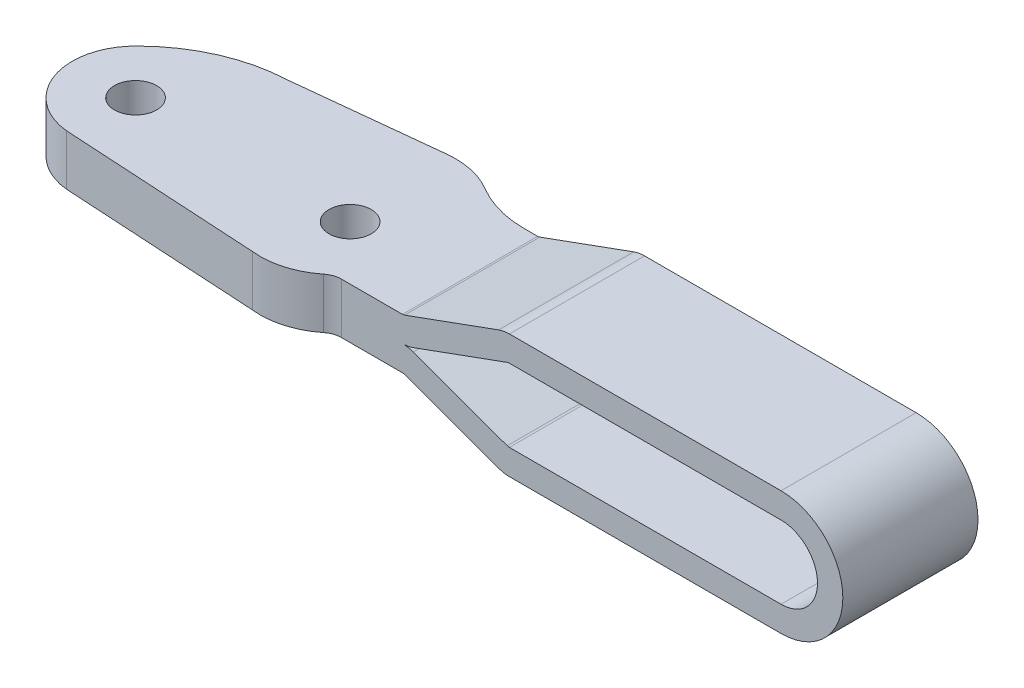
ISO-10303-21;
HEADER;
FILE_DESCRIPTION(('STEP AP214'),'2;1');
FILE_NAME('part.step','',(''),(''),'','','');
FILE_SCHEMA(('AUTOMOTIVE_DESIGN { 1 0 10303 214 1 1 1 1 }'));
ENDSEC;
DATA;
#1=APPLICATION_CONTEXT('core data for automotive mechanical design processes');
#2=APPLICATION_PROTOCOL_DEFINITION('international standard','automotive_design',2000,#1);
#3=PRODUCT_CONTEXT('',#1,'mechanical');
#4=PRODUCT('Part','Part','',(#3));
#5=PRODUCT_RELATED_PRODUCT_CATEGORY('part','',(#4));
#6=PRODUCT_DEFINITION_FORMATION('','',#4);
#7=PRODUCT_DEFINITION_CONTEXT('part definition',#1,'design');
#8=PRODUCT_DEFINITION('design','',#6,#7);
#9=PRODUCT_DEFINITION_SHAPE('','',#8);
#10=(LENGTH_UNIT() NAMED_UNIT(*) SI_UNIT(.MILLI.,.METRE.));
#11=(NAMED_UNIT(*) PLANE_ANGLE_UNIT() SI_UNIT($,.RADIAN.));
#12=(NAMED_UNIT(*) SI_UNIT($,.STERADIAN.) SOLID_ANGLE_UNIT());
#13=UNCERTAINTY_MEASURE_WITH_UNIT(LENGTH_MEASURE(1.E-05),#10,'distance_accuracy_value','');
#14=(GEOMETRIC_REPRESENTATION_CONTEXT(3) GLOBAL_UNCERTAINTY_ASSIGNED_CONTEXT((#13)) GLOBAL_UNIT_ASSIGNED_CONTEXT((#10,
#11,#12)) REPRESENTATION_CONTEXT('',''));
#15=CARTESIAN_POINT('',(0.,0.,0.));
#16=DIRECTION('',(0.,0.,1.));
#17=DIRECTION('',(1.,0.,0.));
#18=AXIS2_PLACEMENT_3D('',#15,#16,#17);
#19=CARTESIAN_POINT('',(30.7813398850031,-2.998,8.94079999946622));
#20=DIRECTION('',(0.,1.,0.));
#21=DIRECTION('',(0.,0.,1.));
#22=AXIS2_PLACEMENT_3D('',#19,#20,#21);
#23=CYLINDRICAL_SURFACE('',#22,2.53999999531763);
#24=CARTESIAN_POINT('',(30.7813398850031,2.998,8.94079999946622));
#25=DIRECTION('',(0.,-1.,0.));
#26=DIRECTION('',(0.,0.,1.));
#27=AXIS2_PLACEMENT_3D('',#24,#25,#26);
#28=CIRCLE('',#27,2.53999999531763);
#29=CARTESIAN_POINT('',(29.1989211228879,2.998,6.95395555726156));
#30=VERTEX_POINT('',#29);
#31=CARTESIAN_POINT('',(30.7813398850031,2.998,6.4008000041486));
#32=VERTEX_POINT('',#31);
#33=EDGE_CURVE('E123',#30,#32,#28,.T.);
#34=ORIENTED_EDGE('',*,*,#33,.F.);
#35=DIRECTION('',(0.,1.,0.));
#36=VECTOR('',#35,1.);
#37=CARTESIAN_POINT('',(29.1989211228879,-2.998,6.95395555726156));
#38=LINE('',#37,#36);
#39=CARTESIAN_POINT('',(29.1989211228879,-2.998,6.95395555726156));
#40=VERTEX_POINT('',#39);
#41=EDGE_CURVE('E9',#40,#30,#38,.T.);
#42=ORIENTED_EDGE('',*,*,#41,.F.);
#43=CARTESIAN_POINT('',(30.7813398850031,-2.998,8.94079999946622));
#44=DIRECTION('',(0.,-1.,0.));
#45=DIRECTION('',(0.,0.,1.));
#46=AXIS2_PLACEMENT_3D('',#43,#44,#45);
#47=CIRCLE('',#46,2.53999999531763);
#48=CARTESIAN_POINT('',(30.7813398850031,-2.998,6.4008000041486));
#49=VERTEX_POINT('',#48);
#50=EDGE_CURVE('E149',#40,#49,#47,.T.);
#51=ORIENTED_EDGE('',*,*,#50,.T.);
#52=DIRECTION('',(0.,1.,0.));
#53=VECTOR('',#52,1.);
#54=CARTESIAN_POINT('',(30.7813398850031,-2.998,6.4008000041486));
#55=LINE('',#54,#53);
#56=EDGE_CURVE('E17',#49,#32,#55,.T.);
#57=ORIENTED_EDGE('',*,*,#56,.T.);
#58=EDGE_LOOP('',(#34,#42,#51,#57));
#59=FACE_BOUND('',#58,.T.);
#60=ADVANCED_FACE('F14',(#59),#23,.F.);
#61=CARTESIAN_POINT('',(23.6604554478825,-2.998,0.));
#62=DIRECTION('',(0.,1.,0.));
#63=DIRECTION('',(0.,0.,1.));
#64=AXIS2_PLACEMENT_3D('',#61,#62,#63);
#65=CYLINDRICAL_SURFACE('',#64,8.8899999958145);
#66=CARTESIAN_POINT('',(23.6604554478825,2.998,0.));
#67=DIRECTION('',(0.,1.,0.));
#68=DIRECTION('',(0.,0.,1.));
#69=AXIS2_PLACEMENT_3D('',#66,#67,#68);
#70=CIRCLE('',#69,8.8899999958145);
#71=CARTESIAN_POINT('',(22.7060951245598,2.998,8.83862524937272));
#72=VERTEX_POINT('',#71);
#73=EDGE_CURVE('E147',#72,#30,#70,.T.);
#74=ORIENTED_EDGE('',*,*,#73,.F.);
#75=DIRECTION('',(0.,1.,0.));
#76=VECTOR('',#75,1.);
#77=CARTESIAN_POINT('',(22.7060951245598,-2.998,8.83862524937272));
#78=LINE('',#77,#76);
#79=CARTESIAN_POINT('',(22.7060951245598,-2.998,8.83862524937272));
#80=VERTEX_POINT('',#79);
#81=EDGE_CURVE('E23',#80,#72,#78,.T.);
#82=ORIENTED_EDGE('',*,*,#81,.F.);
#83=CARTESIAN_POINT('',(23.6604554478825,-2.998,0.));
#84=DIRECTION('',(0.,1.,0.));
#85=DIRECTION('',(0.,0.,1.));
#86=AXIS2_PLACEMENT_3D('',#83,#84,#85);
#87=CIRCLE('',#86,8.8899999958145);
#88=EDGE_CURVE('E118',#80,#40,#87,.T.);
#89=ORIENTED_EDGE('',*,*,#88,.T.);
#90=ORIENTED_EDGE('',*,*,#41,.T.);
#91=EDGE_LOOP('',(#74,#82,#89,#90));
#92=FACE_BOUND('',#91,.T.);
#93=ADVANCED_FACE('F174',(#92),#65,.T.);
#94=CARTESIAN_POINT('',(-0.681685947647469,-2.998,7.46895603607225));
#95=DIRECTION('',(-0.0584632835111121,0.,0.99828955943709));
#96=DIRECTION('',(-0.99828955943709,0.,-0.0584632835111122));
#97=AXIS2_PLACEMENT_3D('',#94,#95,#96);
#98=PLANE('',#97);
#99=DIRECTION('',(0.99828955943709,0.,0.0584632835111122));
#100=VECTOR('',#99,1.);
#101=CARTESIAN_POINT('',(-0.681685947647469,2.998,7.46895603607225));
#102=LINE('',#101,#100);
#103=CARTESIAN_POINT('',(-0.681685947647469,2.998,7.46895603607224));
#104=VERTEX_POINT('',#103);
#105=EDGE_CURVE('E112',#104,#72,#102,.T.);
#106=ORIENTED_EDGE('',*,*,#105,.F.);
#107=DIRECTION('',(0.,1.,0.));
#108=VECTOR('',#107,1.);
#109=CARTESIAN_POINT('',(-0.681685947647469,-2.998,7.46895603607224));
#110=LINE('',#109,#108);
#111=CARTESIAN_POINT('',(-0.681685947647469,-2.998,7.46895603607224));
#112=VERTEX_POINT('',#111);
#113=EDGE_CURVE('E100',#112,#104,#110,.T.);
#114=ORIENTED_EDGE('',*,*,#113,.F.);
#115=DIRECTION('',(0.99828955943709,0.,0.0584632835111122));
#116=VECTOR('',#115,1.);
#117=CARTESIAN_POINT('',(-0.681685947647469,-2.998,7.46895603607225));
#118=LINE('',#117,#116);
#119=EDGE_CURVE('E107',#112,#80,#118,.T.);
#120=ORIENTED_EDGE('',*,*,#119,.T.);
#121=ORIENTED_EDGE('',*,*,#81,.T.);
#122=EDGE_LOOP('',(#106,#114,#120,#121));
#123=FACE_BOUND('',#122,.T.);
#124=ADVANCED_FACE('F110',(#123),#98,.T.);
#125=CARTESIAN_POINT('',(0.,-2.998,0.));
#126=DIRECTION('',(0.,1.,0.));
#127=DIRECTION('',(0.,0.,1.));
#128=AXIS2_PLACEMENT_3D('',#125,#126,#127);
#129=CYLINDRICAL_SURFACE('',#128,7.5);
#130=CARTESIAN_POINT('',(0.,2.998,0.));
#131=DIRECTION('',(0.,1.,0.));
#132=DIRECTION('',(0.,0.,1.));
#133=AXIS2_PLACEMENT_3D('',#130,#131,#132);
#134=CIRCLE('',#133,7.5);
#135=CARTESIAN_POINT('',(-5.1227872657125,2.998,-5.47786916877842));
#136=VERTEX_POINT('',#135);
#137=EDGE_CURVE('E144',#136,#104,#134,.T.);
#138=ORIENTED_EDGE('',*,*,#137,.F.);
#139=DIRECTION('',(0.,1.,0.));
#140=VECTOR('',#139,1.);
#141=CARTESIAN_POINT('',(-5.1227872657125,-2.998,-5.47786916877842));
#142=LINE('',#141,#140);
#143=CARTESIAN_POINT('',(-5.1227872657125,-2.998,-5.47786916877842));
#144=VERTEX_POINT('',#143);
#145=EDGE_CURVE('E102',#144,#136,#142,.T.);
#146=ORIENTED_EDGE('',*,*,#145,.F.);
#147=CARTESIAN_POINT('',(0.,-2.998,0.));
#148=DIRECTION('',(0.,1.,0.));
#149=DIRECTION('',(0.,0.,1.));
#150=AXIS2_PLACEMENT_3D('',#147,#148,#149);
#151=CIRCLE('',#150,7.5);
#152=EDGE_CURVE('E97',#144,#112,#151,.T.);
#153=ORIENTED_EDGE('',*,*,#152,.T.);
#154=ORIENTED_EDGE('',*,*,#113,.T.);
#155=EDGE_LOOP('',(#138,#146,#153,#154));
#156=FACE_BOUND('',#155,.T.);
#157=ADVANCED_FACE('F99',(#156),#129,.T.);
#158=CARTESIAN_POINT('',(7.92309652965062,-2.998,7.71645072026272));
#159=DIRECTION('',(0.,1.,0.));
#160=DIRECTION('',(0.,0.,1.));
#161=AXIS2_PLACEMENT_3D('',#158,#159,#160);
#162=CYLINDRICAL_SURFACE('',#161,18.5549228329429);
#163=CARTESIAN_POINT('',(7.92309652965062,2.998,7.71645072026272));
#164=DIRECTION('',(0.,1.,0.));
#165=DIRECTION('',(0.,0.,1.));
#166=AXIS2_PLACEMENT_3D('',#163,#164,#165);
#167=CIRCLE('',#166,18.5549228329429);
#168=CARTESIAN_POINT('',(7.14985882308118,2.998,-10.8223535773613));
#169=VERTEX_POINT('',#168);
#170=EDGE_CURVE('E141',#169,#136,#167,.T.);
#171=ORIENTED_EDGE('',*,*,#170,.F.);
#172=DIRECTION('',(0.,1.,0.));
#173=VECTOR('',#172,1.);
#174=CARTESIAN_POINT('',(7.14985882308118,-2.998,-10.8223535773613));
#175=LINE('',#174,#173);
#176=CARTESIAN_POINT('',(7.14985882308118,-2.998,-10.8223535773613));
#177=VERTEX_POINT('',#176);
#178=EDGE_CURVE('E153',#177,#169,#175,.T.);
#179=ORIENTED_EDGE('',*,*,#178,.F.);
#180=CARTESIAN_POINT('',(7.92309652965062,-2.998,7.71645072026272));
#181=DIRECTION('',(0.,1.,0.));
#182=DIRECTION('',(0.,0.,1.));
#183=AXIS2_PLACEMENT_3D('',#180,#181,#182);
#184=CIRCLE('',#183,18.5549228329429);
#185=EDGE_CURVE('E108',#177,#144,#184,.T.);
#186=ORIENTED_EDGE('',*,*,#185,.T.);
#187=ORIENTED_EDGE('',*,*,#145,.T.);
#188=EDGE_LOOP('',(#171,#179,#186,#187));
#189=FACE_BOUND('',#188,.T.);
#190=ADVANCED_FACE('F189',(#189),#162,.T.);
#191=CARTESIAN_POINT('',(24.1837144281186,-2.998,-12.6465664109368));
#192=DIRECTION('',(-0.106484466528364,0.,-0.994314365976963));
#193=DIRECTION('',(0.994314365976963,0.,-0.106484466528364));
#194=AXIS2_PLACEMENT_3D('',#191,#192,#193);
#195=PLANE('',#194);
#196=DIRECTION('',(-0.994314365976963,0.,0.106484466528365));
#197=VECTOR('',#196,1.);
#198=CARTESIAN_POINT('',(24.1837144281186,2.998,-12.6465664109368));
#199=LINE('',#198,#197);
#200=CARTESIAN_POINT('',(24.1837144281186,2.998,-12.6465664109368));
#201=VERTEX_POINT('',#200);
#202=EDGE_CURVE('E138',#201,#169,#199,.T.);
#203=ORIENTED_EDGE('',*,*,#202,.F.);
#204=DIRECTION('',(0.,1.,0.));
#205=VECTOR('',#204,1.);
#206=CARTESIAN_POINT('',(24.1837144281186,-2.998,-12.6465664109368));
#207=LINE('',#206,#205);
#208=CARTESIAN_POINT('',(24.1837144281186,-2.998,-12.6465664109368));
#209=VERTEX_POINT('',#208);
#210=EDGE_CURVE('E155',#209,#201,#207,.T.);
#211=ORIENTED_EDGE('',*,*,#210,.F.);
#212=DIRECTION('',(-0.994314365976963,0.,0.106484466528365));
#213=VECTOR('',#212,1.);
#214=CARTESIAN_POINT('',(24.1837144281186,-2.998,-12.6465664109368));
#215=LINE('',#214,#213);
#216=EDGE_CURVE('E481',#209,#177,#215,.T.);
#217=ORIENTED_EDGE('',*,*,#216,.T.);
#218=ORIENTED_EDGE('',*,*,#178,.T.);
#219=EDGE_LOOP('',(#203,#211,#217,#218));
#220=FACE_BOUND('',#219,.T.);
#221=ADVANCED_FACE('F192',(#220),#195,.T.);
#222=CARTESIAN_POINT('',(25.1844554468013,-2.998,-3.30200000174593));
#223=DIRECTION('',(0.,1.,0.));
#224=DIRECTION('',(0.,0.,1.));
#225=AXIS2_PLACEMENT_3D('',#222,#223,#224);
#226=CYLINDRICAL_SURFACE('',#225,9.39799999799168);
#227=CARTESIAN_POINT('',(25.1844554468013,2.998,-3.30200000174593));
#228=DIRECTION('',(0.,1.,0.));
#229=DIRECTION('',(0.,0.,1.));
#230=AXIS2_PLACEMENT_3D('',#227,#228,#229);
#231=CIRCLE('',#230,9.39799999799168);
#232=CARTESIAN_POINT('',(30.0095440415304,2.998,-11.3667953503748));
#233=VERTEX_POINT('',#232);
#234=EDGE_CURVE('E135',#233,#201,#231,.T.);
#235=ORIENTED_EDGE('',*,*,#234,.F.);
#236=DIRECTION('',(0.,1.,0.));
#237=VECTOR('',#236,1.);
#238=CARTESIAN_POINT('',(30.0095440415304,-2.998,-11.3667953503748));
#239=LINE('',#238,#237);
#240=CARTESIAN_POINT('',(30.0095440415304,-2.998,-11.3667953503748));
#241=VERTEX_POINT('',#240);
#242=EDGE_CURVE('E157',#241,#233,#239,.T.);
#243=ORIENTED_EDGE('',*,*,#242,.F.);
#244=CARTESIAN_POINT('',(25.1844554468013,-2.998,-3.30200000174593));
#245=DIRECTION('',(0.,1.,0.));
#246=DIRECTION('',(0.,0.,1.));
#247=AXIS2_PLACEMENT_3D('',#244,#245,#246);
#248=CIRCLE('',#247,9.39799999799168);
#249=EDGE_CURVE('E478',#241,#209,#248,.T.);
#250=ORIENTED_EDGE('',*,*,#249,.T.);
#251=ORIENTED_EDGE('',*,*,#210,.T.);
#252=EDGE_LOOP('',(#235,#243,#250,#251));
#253=FACE_BOUND('',#252,.T.);
#254=ADVANCED_FACE('F196',(#253),#226,.T.);
#255=CARTESIAN_POINT('',(36.3995262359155,-2.998,-22.0472000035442));
#256=DIRECTION('',(0.,1.,0.));
#257=DIRECTION('',(0.,0.,1.));
#258=AXIS2_PLACEMENT_3D('',#255,#256,#257);
#259=CYLINDRICAL_SURFACE('',#258,12.446);
#260=CARTESIAN_POINT('',(36.3995262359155,2.998,-22.0472000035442));
#261=DIRECTION('',(0.,-1.,0.));
#262=DIRECTION('',(0.,0.,1.));
#263=AXIS2_PLACEMENT_3D('',#260,#261,#262);
#264=CIRCLE('',#263,12.446);
#265=CARTESIAN_POINT('',(36.3995262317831,2.998,-9.60120000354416));
#266=VERTEX_POINT('',#265);
#267=EDGE_CURVE('E132',#266,#233,#264,.T.);
#268=ORIENTED_EDGE('',*,*,#267,.F.);
#269=DIRECTION('',(0.,1.,0.));
#270=VECTOR('',#269,1.);
#271=CARTESIAN_POINT('',(36.3995262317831,-2.998,-9.60120000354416));
#272=LINE('',#271,#270);
#273=CARTESIAN_POINT('',(36.3995262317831,-2.998,-9.60120000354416));
#274=VERTEX_POINT('',#273);
#275=EDGE_CURVE('E158',#274,#266,#272,.T.);
#276=ORIENTED_EDGE('',*,*,#275,.F.);
#277=CARTESIAN_POINT('',(36.3995262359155,-2.998,-22.0472000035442));
#278=DIRECTION('',(0.,-1.,0.));
#279=DIRECTION('',(0.,0.,1.));
#280=AXIS2_PLACEMENT_3D('',#277,#278,#279);
#281=CIRCLE('',#280,12.446);
#282=EDGE_CURVE('E475',#274,#241,#281,.T.);
#283=ORIENTED_EDGE('',*,*,#282,.T.);
#284=ORIENTED_EDGE('',*,*,#242,.T.);
#285=EDGE_LOOP('',(#268,#276,#283,#284));
#286=FACE_BOUND('',#285,.T.);
#287=ADVANCED_FACE('F200',(#286),#259,.F.);
#288=CARTESIAN_POINT('',(38.0004155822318,-2.998,-9.60120000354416));
#289=DIRECTION('',(0.,0.,-1.));
#290=DIRECTION('',(0.,1.,0.));
#291=AXIS2_PLACEMENT_3D('',#288,#289,#290);
#292=PLANE('',#291);
#293=DIRECTION('',(-1.,0.,0.));
#294=VECTOR('',#293,1.);
#295=CARTESIAN_POINT('',(38.0004155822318,2.998,-9.60120000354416));
#296=LINE('',#295,#294);
#297=CARTESIAN_POINT('',(38.0004155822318,2.998,-9.60120000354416));
#298=VERTEX_POINT('',#297);
#299=EDGE_CURVE('E129',#298,#266,#296,.T.);
#300=ORIENTED_EDGE('',*,*,#299,.F.);
#301=CARTESIAN_POINT('',(38.0004155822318,3.738,-9.60120000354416));
#302=DIRECTION('',(0.,0.,1.));
#303=DIRECTION('',(0.,1.,0.));
#304=AXIS2_PLACEMENT_3D('',#301,#302,#303);
#305=CIRCLE('',#304,0.74);
#306=CARTESIAN_POINT('',(38.2535104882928,3.04262746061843,-9.60120000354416));
#307=VERTEX_POINT('',#306);
#308=EDGE_CURVE('E418',#298,#307,#305,.T.);
#309=ORIENTED_EDGE('',*,*,#308,.T.);
#310=DIRECTION('',(0.939692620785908,0.342020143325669,0.));
#311=VECTOR('',#310,1.);
#312=CARTESIAN_POINT('',(38.2535104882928,3.04262746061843,-9.60120000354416));
#313=LINE('',#312,#311);
#314=CARTESIAN_POINT('',(49.3803075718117,7.0924504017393,-9.60120000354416));
#315=VERTEX_POINT('',#314);
#316=EDGE_CURVE('E421',#307,#315,#313,.T.);
#317=ORIENTED_EDGE('',*,*,#316,.T.);
#318=CARTESIAN_POINT('',(50.6594629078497,3.578,-9.60120000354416));
#319=DIRECTION('',(0.,0.,-1.));
#320=DIRECTION('',(0.,1.,0.));
#321=AXIS2_PLACEMENT_3D('',#318,#319,#320);
#322=CIRCLE('',#321,3.74);
#323=CARTESIAN_POINT('',(50.6594629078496,7.318,-9.60120000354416));
#324=VERTEX_POINT('',#323);
#325=EDGE_CURVE('E424',#315,#324,#322,.T.);
#326=ORIENTED_EDGE('',*,*,#325,.T.);
#327=DIRECTION('',(1.,0.,0.));
#328=VECTOR('',#327,1.);
#329=CARTESIAN_POINT('',(50.6594629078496,7.318,-9.60120000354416));
#330=LINE('',#329,#328);
#331=CARTESIAN_POINT('',(82.816475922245,7.318,-9.60120000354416));
#332=VERTEX_POINT('',#331);
#333=EDGE_CURVE('E427',#324,#332,#330,.T.);
#334=ORIENTED_EDGE('',*,*,#333,.T.);
#335=CARTESIAN_POINT('',(82.816475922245,0.,-9.60120000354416));
#336=DIRECTION('',(0.,0.,-1.));
#337=DIRECTION('',(0.,1.,0.));
#338=AXIS2_PLACEMENT_3D('',#335,#336,#337);
#339=CIRCLE('',#338,7.318);
#340=CARTESIAN_POINT('',(82.816475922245,-7.318,-9.60120000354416));
#341=VERTEX_POINT('',#340);
#342=EDGE_CURVE('E317',#332,#341,#339,.T.);
#343=ORIENTED_EDGE('',*,*,#342,.T.);
#344=DIRECTION('',(-1.,0.,0.));
#345=VECTOR('',#344,1.);
#346=CARTESIAN_POINT('',(82.816475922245,-7.318,-9.60120000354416));
#347=LINE('',#346,#345);
#348=CARTESIAN_POINT('',(50.6594629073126,-7.31799999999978,-9.60120000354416));
#349=VERTEX_POINT('',#348);
#350=EDGE_CURVE('E406',#341,#349,#347,.T.);
#351=ORIENTED_EDGE('',*,*,#350,.T.);
#352=CARTESIAN_POINT('',(50.6594629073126,-3.57799999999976,-9.60120000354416));
#353=DIRECTION('',(0.,0.,-1.));
#354=DIRECTION('',(0.,1.,0.));
#355=AXIS2_PLACEMENT_3D('',#352,#353,#354);
#356=CIRCLE('',#355,3.74);
#357=CARTESIAN_POINT('',(49.3803075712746,-7.0924504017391,-9.60120000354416));
#358=VERTEX_POINT('',#357);
#359=EDGE_CURVE('E409',#349,#358,#356,.T.);
#360=ORIENTED_EDGE('',*,*,#359,.T.);
#361=DIRECTION('',(-0.939692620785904,0.34202014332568,0.));
#362=VECTOR('',#361,1.);
#363=CARTESIAN_POINT('',(49.3803075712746,-7.0924504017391,-9.60120000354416));
#364=LINE('',#363,#362);
#365=CARTESIAN_POINT('',(38.2535104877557,-3.04262746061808,-9.60120000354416));
#366=VERTEX_POINT('',#365);
#367=EDGE_CURVE('E412',#358,#366,#364,.T.);
#368=ORIENTED_EDGE('',*,*,#367,.T.);
#369=CARTESIAN_POINT('',(38.0004155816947,-3.73799999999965,-9.60120000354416));
#370=DIRECTION('',(0.,0.,1.));
#371=DIRECTION('',(0.,1.,0.));
#372=AXIS2_PLACEMENT_3D('',#369,#370,#371);
#373=CIRCLE('',#372,0.74);
#374=CARTESIAN_POINT('',(38.0004155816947,-2.99799999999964,-9.60120000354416));
#375=VERTEX_POINT('',#374);
#376=EDGE_CURVE('E415',#366,#375,#373,.T.);
#377=ORIENTED_EDGE('',*,*,#376,.T.);
#378=DIRECTION('',(-1.,0.,0.));
#379=VECTOR('',#378,1.);
#380=CARTESIAN_POINT('',(38.0004155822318,-2.998,-9.60120000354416));
#381=LINE('',#380,#379);
#382=EDGE_CURVE('E473',#375,#274,#381,.T.);
#383=ORIENTED_EDGE('',*,*,#382,.T.);
#384=ORIENTED_EDGE('',*,*,#275,.T.);
#385=EDGE_LOOP('',(#300,#309,#317,#326,#334,#343,#351,#360,#368,#377,#383,#384));
#386=FACE_BOUND('',#385,.T.);
#387=CARTESIAN_POINT('',(82.816475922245,0.,-9.60120000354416));
#388=DIRECTION('',(0.,0.,-1.));
#389=DIRECTION('',(0.,1.,0.));
#390=AXIS2_PLACEMENT_3D('',#387,#388,#389);
#391=CIRCLE('',#390,4.318);
#392=CARTESIAN_POINT('',(82.816475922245,4.318,-9.60120000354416));
#393=VERTEX_POINT('',#392);
#394=CARTESIAN_POINT('',(82.816475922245,-4.318,-9.60120000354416));
#395=VERTEX_POINT('',#394);
#396=EDGE_CURVE('E360',#393,#395,#391,.T.);
#397=ORIENTED_EDGE('',*,*,#396,.F.);
#398=DIRECTION('',(1.,0.,0.));
#399=VECTOR('',#398,1.);
#400=CARTESIAN_POINT('',(50.6594629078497,4.318,-9.60120000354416));
#401=LINE('',#400,#399);
#402=CARTESIAN_POINT('',(50.6594629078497,4.318,-9.60120000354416));
#403=VERTEX_POINT('',#402);
#404=EDGE_CURVE('E312',#403,#393,#401,.T.);
#405=ORIENTED_EDGE('',*,*,#404,.F.);
#406=CARTESIAN_POINT('',(50.6594629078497,3.578,-9.60120000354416));
#407=DIRECTION('',(0.,0.,-1.));
#408=DIRECTION('',(0.,1.,0.));
#409=AXIS2_PLACEMENT_3D('',#406,#407,#408);
#410=CIRCLE('',#409,0.740000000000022);
#411=CARTESIAN_POINT('',(50.4063680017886,4.27337253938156,-9.60120000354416));
#412=VERTEX_POINT('',#411);
#413=EDGE_CURVE('E380',#412,#403,#410,.T.);
#414=ORIENTED_EDGE('',*,*,#413,.F.);
#415=DIRECTION('',(0.939692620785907,0.342020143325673,0.));
#416=VECTOR('',#415,1.);
#417=CARTESIAN_POINT('',(39.2795709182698,0.223549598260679,-9.60120000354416));
#418=LINE('',#417,#416);
#419=CARTESIAN_POINT('',(39.2795709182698,0.223549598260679,-9.60120000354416));
#420=VERTEX_POINT('',#419);
#421=EDGE_CURVE('E377',#420,#412,#418,.T.);
#422=ORIENTED_EDGE('',*,*,#421,.F.);
#423=CARTESIAN_POINT('',(38.0004155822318,3.738,-9.60120000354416));
#424=DIRECTION('',(0.,0.,1.));
#425=DIRECTION('',(0.,1.,0.));
#426=AXIS2_PLACEMENT_3D('',#423,#424,#425);
#427=CIRCLE('',#426,3.74);
#428=CARTESIAN_POINT('',(38.122710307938,-8.64152499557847E-12,-9.60120000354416));
#429=VERTEX_POINT('',#428);
#430=EDGE_CURVE('E374',#429,#420,#427,.T.);
#431=ORIENTED_EDGE('',*,*,#430,.F.);
#432=CARTESIAN_POINT('',(38.0004155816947,-3.73799999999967,-9.60120000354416));
#433=DIRECTION('',(0.,0.,1.));
#434=DIRECTION('',(0.,1.,0.));
#435=AXIS2_PLACEMENT_3D('',#432,#433,#434);
#436=CIRCLE('',#435,3.74);
#437=CARTESIAN_POINT('',(39.2795709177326,-0.223549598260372,-9.60120000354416));
#438=VERTEX_POINT('',#437);
#439=EDGE_CURVE('E371',#438,#429,#436,.T.);
#440=ORIENTED_EDGE('',*,*,#439,.F.);
#441=DIRECTION('',(-0.939692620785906,0.342020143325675,0.));
#442=VECTOR('',#441,1.);
#443=CARTESIAN_POINT('',(50.4063680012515,-4.27337253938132,-9.60120000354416));
#444=LINE('',#443,#442);
#445=CARTESIAN_POINT('',(50.4063680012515,-4.27337253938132,-9.60120000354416));
#446=VERTEX_POINT('',#445);
#447=EDGE_CURVE('E368',#446,#438,#444,.T.);
#448=ORIENTED_EDGE('',*,*,#447,.F.);
#449=CARTESIAN_POINT('',(50.6594629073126,-3.57799999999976,-9.60120000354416));
#450=DIRECTION('',(0.,0.,-1.));
#451=DIRECTION('',(0.,1.,0.));
#452=AXIS2_PLACEMENT_3D('',#449,#450,#451);
#453=CIRCLE('',#452,0.740000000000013);
#454=CARTESIAN_POINT('',(50.6594629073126,-4.31799999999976,-9.60120000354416));
#455=VERTEX_POINT('',#454);
#456=EDGE_CURVE('E365',#455,#446,#453,.T.);
#457=ORIENTED_EDGE('',*,*,#456,.F.);
#458=DIRECTION('',(-1.,0.,0.));
#459=VECTOR('',#458,1.);
#460=CARTESIAN_POINT('',(82.816475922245,-4.318,-9.60120000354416));
#461=LINE('',#460,#459);
#462=EDGE_CURVE('E362',#395,#455,#461,.T.);
#463=ORIENTED_EDGE('',*,*,#462,.F.);
#464=EDGE_LOOP('',(#397,#405,#414,#422,#431,#440,#448,#457,#463));
#465=FACE_BOUND('',#464,.T.);
#466=ADVANCED_FACE('F204',(#386,#465),#292,.T.);
#467=CARTESIAN_POINT('',(30.7813398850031,-2.998,6.4008000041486));
#468=DIRECTION('',(0.,0.,1.));
#469=DIRECTION('',(-1.,0.,0.));
#470=AXIS2_PLACEMENT_3D('',#467,#468,#469);
#471=PLANE('',#470);
#472=DIRECTION('',(1.,0.,0.));
#473=VECTOR('',#472,1.);
#474=CARTESIAN_POINT('',(30.7813398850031,-2.998,6.4008000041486));
#475=LINE('',#474,#473);
#476=CARTESIAN_POINT('',(38.0004155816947,-2.99799999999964,6.4008000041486));
#477=VERTEX_POINT('',#476);
#478=EDGE_CURVE('E471',#49,#477,#475,.T.);
#479=ORIENTED_EDGE('',*,*,#478,.T.);
#480=CARTESIAN_POINT('',(38.0004155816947,-3.73799999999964,6.4008000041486));
#481=DIRECTION('',(0.,0.,-1.));
#482=DIRECTION('',(1.,0.,0.));
#483=AXIS2_PLACEMENT_3D('',#480,#481,#482);
#484=CIRCLE('',#483,0.74);
#485=CARTESIAN_POINT('',(38.2535104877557,-3.04262746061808,6.4008000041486));
#486=VERTEX_POINT('',#485);
#487=EDGE_CURVE('E349',#477,#486,#484,.T.);
#488=ORIENTED_EDGE('',*,*,#487,.T.);
#489=DIRECTION('',(0.939692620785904,-0.34202014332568,0.));
#490=VECTOR('',#489,1.);
#491=CARTESIAN_POINT('',(49.3803075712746,-7.0924504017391,6.4008000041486));
#492=LINE('',#491,#490);
#493=CARTESIAN_POINT('',(49.3803075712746,-7.09245040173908,6.4008000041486));
#494=VERTEX_POINT('',#493);
#495=EDGE_CURVE('E345',#486,#494,#492,.T.);
#496=ORIENTED_EDGE('',*,*,#495,.T.);
#497=CARTESIAN_POINT('',(50.6594629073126,-3.57799999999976,6.4008000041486));
#498=DIRECTION('',(0.,0.,-1.));
#499=DIRECTION('',(1.,0.,0.));
#500=AXIS2_PLACEMENT_3D('',#497,#498,#499);
#501=CIRCLE('',#500,3.74);
#502=CARTESIAN_POINT('',(50.6594629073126,-7.31799999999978,6.4008000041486));
#503=VERTEX_POINT('',#502);
#504=EDGE_CURVE('E342',#494,#503,#501,.F.);
#505=ORIENTED_EDGE('',*,*,#504,.T.);
#506=DIRECTION('',(1.,0.,0.));
#507=VECTOR('',#506,1.);
#508=CARTESIAN_POINT('',(82.816475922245,-7.318,6.4008000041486));
#509=LINE('',#508,#507);
#510=CARTESIAN_POINT('',(82.816475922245,-7.318,6.4008000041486));
#511=VERTEX_POINT('',#510);
#512=EDGE_CURVE('E337',#503,#511,#509,.T.);
#513=ORIENTED_EDGE('',*,*,#512,.T.);
#514=CARTESIAN_POINT('',(82.816475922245,0.,6.4008000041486));
#515=DIRECTION('',(0.,0.,-1.));
#516=DIRECTION('',(1.,0.,0.));
#517=AXIS2_PLACEMENT_3D('',#514,#515,#516);
#518=CIRCLE('',#517,7.318);
#519=CARTESIAN_POINT('',(82.816475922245,7.318,6.40080000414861));
#520=VERTEX_POINT('',#519);
#521=EDGE_CURVE('E328',#511,#520,#518,.F.);
#522=ORIENTED_EDGE('',*,*,#521,.T.);
#523=DIRECTION('',(-1.,0.,0.));
#524=VECTOR('',#523,1.);
#525=CARTESIAN_POINT('',(50.6594629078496,7.318,6.4008000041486));
#526=LINE('',#525,#524);
#527=CARTESIAN_POINT('',(50.6594629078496,7.318,6.4008000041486));
#528=VERTEX_POINT('',#527);
#529=EDGE_CURVE('E333',#520,#528,#526,.T.);
#530=ORIENTED_EDGE('',*,*,#529,.T.);
#531=CARTESIAN_POINT('',(50.6594629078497,3.578,6.4008000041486));
#532=DIRECTION('',(0.,0.,-1.));
#533=DIRECTION('',(1.,0.,0.));
#534=AXIS2_PLACEMENT_3D('',#531,#532,#533);
#535=CIRCLE('',#534,3.74);
#536=CARTESIAN_POINT('',(49.3803075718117,7.09245040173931,6.4008000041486));
#537=VERTEX_POINT('',#536);
#538=EDGE_CURVE('E355',#528,#537,#535,.F.);
#539=ORIENTED_EDGE('',*,*,#538,.T.);
#540=DIRECTION('',(-0.939692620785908,-0.342020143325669,0.));
#541=VECTOR('',#540,1.);
#542=CARTESIAN_POINT('',(38.2535104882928,3.04262746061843,6.4008000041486));
#543=LINE('',#542,#541);
#544=CARTESIAN_POINT('',(38.2535104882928,3.04262746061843,6.4008000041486));
#545=VERTEX_POINT('',#544);
#546=EDGE_CURVE('E353',#537,#545,#543,.T.);
#547=ORIENTED_EDGE('',*,*,#546,.T.);
#548=CARTESIAN_POINT('',(38.0004155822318,3.738,6.4008000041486));
#549=DIRECTION('',(0.,0.,-1.));
#550=DIRECTION('',(1.,0.,0.));
#551=AXIS2_PLACEMENT_3D('',#548,#549,#550);
#552=CIRCLE('',#551,0.74);
#553=CARTESIAN_POINT('',(38.0004155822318,2.998,6.40080000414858));
#554=VERTEX_POINT('',#553);
#555=EDGE_CURVE('E168',#545,#554,#552,.T.);
#556=ORIENTED_EDGE('',*,*,#555,.T.);
#557=DIRECTION('',(1.,0.,0.));
#558=VECTOR('',#557,1.);
#559=CARTESIAN_POINT('',(30.7813398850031,2.998,6.4008000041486));
#560=LINE('',#559,#558);
#561=EDGE_CURVE('E126',#32,#554,#560,.T.);
#562=ORIENTED_EDGE('',*,*,#561,.F.);
#563=ORIENTED_EDGE('',*,*,#56,.F.);
#564=EDGE_LOOP('',(#479,#488,#496,#505,#513,#522,#530,#539,#547,#556,#562,#563));
#565=FACE_BOUND('',#564,.T.);
#566=DIRECTION('',(1.,0.,0.));
#567=VECTOR('',#566,1.);
#568=CARTESIAN_POINT('',(82.816475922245,-4.318,6.4008000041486));
#569=LINE('',#568,#567);
#570=CARTESIAN_POINT('',(50.6594629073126,-4.31799999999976,6.4008000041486));
#571=VERTEX_POINT('',#570);
#572=CARTESIAN_POINT('',(82.816475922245,-4.318,6.4008000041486));
#573=VERTEX_POINT('',#572);
#574=EDGE_CURVE('E346',#571,#573,#569,.T.);
#575=ORIENTED_EDGE('',*,*,#574,.F.);
#576=CARTESIAN_POINT('',(50.6594629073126,-3.57799999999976,6.4008000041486));
#577=DIRECTION('',(0.,0.,-1.));
#578=DIRECTION('',(1.,0.,0.));
#579=AXIS2_PLACEMENT_3D('',#576,#577,#578);
#580=CIRCLE('',#579,0.740000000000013);
#581=CARTESIAN_POINT('',(50.4063680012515,-4.2733725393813,6.4008000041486));
#582=VERTEX_POINT('',#581);
#583=EDGE_CURVE('E341',#582,#571,#580,.F.);
#584=ORIENTED_EDGE('',*,*,#583,.F.);
#585=DIRECTION('',(0.939692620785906,-0.342020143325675,0.));
#586=VECTOR('',#585,1.);
#587=CARTESIAN_POINT('',(50.4063680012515,-4.27337253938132,6.4008000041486));
#588=LINE('',#587,#586);
#589=CARTESIAN_POINT('',(39.2795709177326,-0.223549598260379,6.4008000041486));
#590=VERTEX_POINT('',#589);
#591=EDGE_CURVE('E547',#590,#582,#588,.T.);
#592=ORIENTED_EDGE('',*,*,#591,.F.);
#593=CARTESIAN_POINT('',(38.0004155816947,-3.73799999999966,6.4008000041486));
#594=DIRECTION('',(0.,0.,-1.));
#595=DIRECTION('',(1.,0.,0.));
#596=AXIS2_PLACEMENT_3D('',#593,#594,#595);
#597=CIRCLE('',#596,3.74);
#598=CARTESIAN_POINT('',(38.122710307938,-8.6389229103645E-12,6.4008000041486));
#599=VERTEX_POINT('',#598);
#600=EDGE_CURVE('E611',#599,#590,#597,.T.);
#601=ORIENTED_EDGE('',*,*,#600,.F.);
#602=CARTESIAN_POINT('',(38.0004155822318,3.738,6.4008000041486));
#603=DIRECTION('',(0.,0.,-1.));
#604=DIRECTION('',(1.,0.,0.));
#605=AXIS2_PLACEMENT_3D('',#602,#603,#604);
#606=CIRCLE('',#605,3.74);
#607=CARTESIAN_POINT('',(39.2795709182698,0.223549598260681,6.4008000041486));
#608=VERTEX_POINT('',#607);
#609=EDGE_CURVE('E608',#608,#599,#606,.T.);
#610=ORIENTED_EDGE('',*,*,#609,.F.);
#611=DIRECTION('',(-0.939692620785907,-0.342020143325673,0.));
#612=VECTOR('',#611,1.);
#613=CARTESIAN_POINT('',(39.2795709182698,0.223549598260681,6.4008000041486));
#614=LINE('',#613,#612);
#615=CARTESIAN_POINT('',(50.4063680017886,4.27337253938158,6.4008000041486));
#616=VERTEX_POINT('',#615);
#617=EDGE_CURVE('E605',#616,#608,#614,.T.);
#618=ORIENTED_EDGE('',*,*,#617,.F.);
#619=CARTESIAN_POINT('',(50.6594629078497,3.578,6.4008000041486));
#620=DIRECTION('',(0.,0.,-1.));
#621=DIRECTION('',(1.,0.,0.));
#622=AXIS2_PLACEMENT_3D('',#619,#620,#621);
#623=CIRCLE('',#622,0.740000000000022);
#624=CARTESIAN_POINT('',(50.6594629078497,4.318,6.4008000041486));
#625=VERTEX_POINT('',#624);
#626=EDGE_CURVE('E330',#625,#616,#623,.F.);
#627=ORIENTED_EDGE('',*,*,#626,.F.);
#628=DIRECTION('',(-1.,0.,0.));
#629=VECTOR('',#628,1.);
#630=CARTESIAN_POINT('',(50.6594629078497,4.318,6.4008000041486));
#631=LINE('',#630,#629);
#632=CARTESIAN_POINT('',(82.816475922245,4.318,6.40080000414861));
#633=VERTEX_POINT('',#632);
#634=EDGE_CURVE('E309',#633,#625,#631,.T.);
#635=ORIENTED_EDGE('',*,*,#634,.F.);
#636=CARTESIAN_POINT('',(82.816475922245,0.,6.4008000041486));
#637=DIRECTION('',(0.,0.,-1.));
#638=DIRECTION('',(1.,0.,0.));
#639=AXIS2_PLACEMENT_3D('',#636,#637,#638);
#640=CIRCLE('',#639,4.318);
#641=EDGE_CURVE('E322',#573,#633,#640,.F.);
#642=ORIENTED_EDGE('',*,*,#641,.F.);
#643=EDGE_LOOP('',(#575,#584,#592,#601,#610,#618,#627,#635,#642));
#644=FACE_BOUND('',#643,.T.);
#645=ADVANCED_FACE('F164',(#565,#644),#471,.T.);
#646=CARTESIAN_POINT('',(30.7813398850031,-2.998,8.94079999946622));
#647=DIRECTION('',(0.,1.,0.));
#648=DIRECTION('',(0.,0.,1.));
#649=AXIS2_PLACEMENT_3D('',#646,#647,#648);
#650=PLANE('',#649);
#651=DIRECTION('',(0.,0.,-1.));
#652=VECTOR('',#651,1.);
#653=CARTESIAN_POINT('',(38.0004155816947,-2.99799999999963,62.0933247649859));
#654=LINE('',#653,#652);
#655=EDGE_CURVE('E445',#477,#375,#654,.T.);
#656=ORIENTED_EDGE('',*,*,#655,.F.);
#657=ORIENTED_EDGE('',*,*,#478,.F.);
#658=ORIENTED_EDGE('',*,*,#50,.F.);
#659=ORIENTED_EDGE('',*,*,#88,.F.);
#660=ORIENTED_EDGE('',*,*,#119,.F.);
#661=ORIENTED_EDGE('',*,*,#152,.F.);
#662=ORIENTED_EDGE('',*,*,#185,.F.);
#663=ORIENTED_EDGE('',*,*,#216,.F.);
#664=ORIENTED_EDGE('',*,*,#249,.F.);
#665=ORIENTED_EDGE('',*,*,#282,.F.);
#666=ORIENTED_EDGE('',*,*,#382,.F.);
#667=EDGE_LOOP('',(#656,#657,#658,#659,#660,#661,#662,#663,#664,#665,#666));
#668=FACE_BOUND('',#667,.T.);
#669=CARTESIAN_POINT('',(25.4,-2.998,0.));
#670=DIRECTION('',(0.,1.,0.));
#671=DIRECTION('',(0.,0.,1.));
#672=AXIS2_PLACEMENT_3D('',#669,#670,#671);
#673=CIRCLE('',#672,2.5);
#674=CARTESIAN_POINT('',(25.4,-2.998,2.5));
#675=VERTEX_POINT('',#674);
#676=EDGE_CURVE('E127',#675,#675,#673,.T.);
#677=ORIENTED_EDGE('',*,*,#676,.T.);
#678=EDGE_LOOP('',(#677));
#679=FACE_BOUND('',#678,.T.);
#680=CARTESIAN_POINT('',(0.,-2.998,0.));
#681=DIRECTION('',(0.,1.,0.));
#682=DIRECTION('',(0.,0.,1.));
#683=AXIS2_PLACEMENT_3D('',#680,#681,#682);
#684=CIRCLE('',#683,2.5);
#685=CARTESIAN_POINT('',(0.,-2.998,2.5));
#686=VERTEX_POINT('',#685);
#687=EDGE_CURVE('E460',#686,#686,#684,.T.);
#688=ORIENTED_EDGE('',*,*,#687,.T.);
#689=EDGE_LOOP('',(#688));
#690=FACE_BOUND('',#689,.T.);
#691=ADVANCED_FACE('F116',(#668,#679,#690),#650,.F.);
#692=CARTESIAN_POINT('',(30.7813398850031,2.998,8.94079999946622));
#693=DIRECTION('',(0.,1.,0.));
#694=DIRECTION('',(0.,0.,1.));
#695=AXIS2_PLACEMENT_3D('',#692,#693,#694);
#696=PLANE('',#695);
#697=ORIENTED_EDGE('',*,*,#299,.T.);
#698=ORIENTED_EDGE('',*,*,#267,.T.);
#699=ORIENTED_EDGE('',*,*,#234,.T.);
#700=ORIENTED_EDGE('',*,*,#202,.T.);
#701=ORIENTED_EDGE('',*,*,#170,.T.);
#702=ORIENTED_EDGE('',*,*,#137,.T.);
#703=ORIENTED_EDGE('',*,*,#105,.T.);
#704=ORIENTED_EDGE('',*,*,#73,.T.);
#705=ORIENTED_EDGE('',*,*,#33,.T.);
#706=ORIENTED_EDGE('',*,*,#561,.T.);
#707=DIRECTION('',(0.,0.,-1.));
#708=VECTOR('',#707,1.);
#709=CARTESIAN_POINT('',(38.0004155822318,2.998,62.0933247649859));
#710=LINE('',#709,#708);
#711=EDGE_CURVE('E443',#554,#298,#710,.T.);
#712=ORIENTED_EDGE('',*,*,#711,.T.);
#713=EDGE_LOOP('',(#697,#698,#699,#700,#701,#702,#703,#704,#705,#706,#712));
#714=FACE_BOUND('',#713,.T.);
#715=CARTESIAN_POINT('',(0.,2.998,0.));
#716=DIRECTION('',(0.,1.,0.));
#717=DIRECTION('',(0.,0.,1.));
#718=AXIS2_PLACEMENT_3D('',#715,#716,#717);
#719=CIRCLE('',#718,2.5);
#720=CARTESIAN_POINT('',(0.,2.998,2.5));
#721=VERTEX_POINT('',#720);
#722=EDGE_CURVE('E340',#721,#721,#719,.T.);
#723=ORIENTED_EDGE('',*,*,#722,.F.);
#724=EDGE_LOOP('',(#723));
#725=FACE_BOUND('',#724,.T.);
#726=CARTESIAN_POINT('',(25.4,2.998,0.));
#727=DIRECTION('',(0.,1.,0.));
#728=DIRECTION('',(0.,0.,1.));
#729=AXIS2_PLACEMENT_3D('',#726,#727,#728);
#730=CIRCLE('',#729,2.5);
#731=CARTESIAN_POINT('',(25.4,2.998,2.5));
#732=VERTEX_POINT('',#731);
#733=EDGE_CURVE('E463',#732,#732,#730,.T.);
#734=ORIENTED_EDGE('',*,*,#733,.F.);
#735=EDGE_LOOP('',(#734));
#736=FACE_BOUND('',#735,.T.);
#737=ADVANCED_FACE('F172',(#714,#725,#736),#696,.T.);
#738=CARTESIAN_POINT('',(25.4,-2.998,0.));
#739=DIRECTION('',(0.,1.,0.));
#740=DIRECTION('',(0.,0.,1.));
#741=AXIS2_PLACEMENT_3D('',#738,#739,#740);
#742=CYLINDRICAL_SURFACE('',#741,2.5);
#743=ORIENTED_EDGE('',*,*,#676,.F.);
#744=EDGE_LOOP('',(#743));
#745=FACE_BOUND('',#744,.T.);
#746=ORIENTED_EDGE('',*,*,#733,.T.);
#747=EDGE_LOOP('',(#746));
#748=FACE_BOUND('',#747,.T.);
#749=ADVANCED_FACE('F216',(#745,#748),#742,.F.);
#750=CARTESIAN_POINT('',(0.,-2.998,0.));
#751=DIRECTION('',(0.,1.,0.));
#752=DIRECTION('',(0.,0.,1.));
#753=AXIS2_PLACEMENT_3D('',#750,#751,#752);
#754=CYLINDRICAL_SURFACE('',#753,2.5);
#755=ORIENTED_EDGE('',*,*,#687,.F.);
#756=EDGE_LOOP('',(#755));
#757=FACE_BOUND('',#756,.T.);
#758=ORIENTED_EDGE('',*,*,#722,.T.);
#759=EDGE_LOOP('',(#758));
#760=FACE_BOUND('',#759,.T.);
#761=ADVANCED_FACE('F220',(#757,#760),#754,.F.);
#762=CARTESIAN_POINT('',(82.816475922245,-7.318,62.0933247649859));
#763=DIRECTION('',(0.,-1.,0.));
#764=DIRECTION('',(1.,0.,0.));
#765=AXIS2_PLACEMENT_3D('',#762,#763,#764);
#766=PLANE('',#765);
#767=ORIENTED_EDGE('',*,*,#512,.F.);
#768=DIRECTION('',(0.,0.,-1.));
#769=VECTOR('',#768,1.);
#770=CARTESIAN_POINT('',(50.6594629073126,-7.31799999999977,62.0933247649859));
#771=LINE('',#770,#769);
#772=EDGE_CURVE('E454',#503,#349,#771,.T.);
#773=ORIENTED_EDGE('',*,*,#772,.T.);
#774=ORIENTED_EDGE('',*,*,#350,.F.);
#775=DIRECTION('',(0.,0.,-1.));
#776=VECTOR('',#775,1.);
#777=CARTESIAN_POINT('',(82.816475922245,-7.318,62.0933247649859));
#778=LINE('',#777,#776);
#779=EDGE_CURVE('E430',#511,#341,#778,.T.);
#780=ORIENTED_EDGE('',*,*,#779,.F.);
#781=EDGE_LOOP('',(#767,#773,#774,#780));
#782=FACE_BOUND('',#781,.T.);
#783=ADVANCED_FACE('F224',(#782),#766,.T.);
#784=CARTESIAN_POINT('',(50.6594629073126,-3.57799999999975,62.0933247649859));
#785=DIRECTION('',(0.,0.,-1.));
#786=DIRECTION('',(0.,1.,0.));
#787=AXIS2_PLACEMENT_3D('',#784,#785,#786);
#788=CYLINDRICAL_SURFACE('',#787,3.74);
#789=ORIENTED_EDGE('',*,*,#504,.F.);
#790=DIRECTION('',(0.,0.,-1.));
#791=VECTOR('',#790,1.);
#792=CARTESIAN_POINT('',(49.3803075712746,-7.09245040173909,62.0933247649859));
#793=LINE('',#792,#791);
#794=EDGE_CURVE('E451',#494,#358,#793,.T.);
#795=ORIENTED_EDGE('',*,*,#794,.T.);
#796=ORIENTED_EDGE('',*,*,#359,.F.);
#797=ORIENTED_EDGE('',*,*,#772,.F.);
#798=EDGE_LOOP('',(#789,#795,#796,#797));
#799=FACE_BOUND('',#798,.T.);
#800=ADVANCED_FACE('F234',(#799),#788,.T.);
#801=CARTESIAN_POINT('',(49.3803075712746,-7.09245040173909,62.0933247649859));
#802=DIRECTION('',(-0.34202014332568,-0.939692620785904,0.));
#803=DIRECTION('',(0.939692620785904,-0.34202014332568,0.));
#804=AXIS2_PLACEMENT_3D('',#801,#802,#803);
#805=PLANE('',#804);
#806=ORIENTED_EDGE('',*,*,#495,.F.);
#807=DIRECTION('',(0.,0.,-1.));
#808=VECTOR('',#807,1.);
#809=CARTESIAN_POINT('',(38.2535104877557,-3.04262746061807,62.0933247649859));
#810=LINE('',#809,#808);
#811=EDGE_CURVE('E448',#486,#366,#810,.T.);
#812=ORIENTED_EDGE('',*,*,#811,.T.);
#813=ORIENTED_EDGE('',*,*,#367,.F.);
#814=ORIENTED_EDGE('',*,*,#794,.F.);
#815=EDGE_LOOP('',(#806,#812,#813,#814));
#816=FACE_BOUND('',#815,.T.);
#817=ADVANCED_FACE('F238',(#816),#805,.T.);
#818=CARTESIAN_POINT('',(38.0004155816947,-3.73799999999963,62.0933247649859));
#819=DIRECTION('',(0.,0.,-1.));
#820=DIRECTION('',(0.,1.,0.));
#821=AXIS2_PLACEMENT_3D('',#818,#819,#820);
#822=CYLINDRICAL_SURFACE('',#821,0.74);
#823=ORIENTED_EDGE('',*,*,#487,.F.);
#824=ORIENTED_EDGE('',*,*,#655,.T.);
#825=ORIENTED_EDGE('',*,*,#376,.F.);
#826=ORIENTED_EDGE('',*,*,#811,.F.);
#827=EDGE_LOOP('',(#823,#824,#825,#826));
#828=FACE_BOUND('',#827,.T.);
#829=ADVANCED_FACE('F242',(#828),#822,.F.);
#830=CARTESIAN_POINT('',(38.0004155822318,3.738,62.0933247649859));
#831=DIRECTION('',(0.,0.,-1.));
#832=DIRECTION('',(0.,1.,0.));
#833=AXIS2_PLACEMENT_3D('',#830,#831,#832);
#834=CYLINDRICAL_SURFACE('',#833,0.74);
#835=ORIENTED_EDGE('',*,*,#555,.F.);
#836=DIRECTION('',(0.,0.,-1.));
#837=VECTOR('',#836,1.);
#838=CARTESIAN_POINT('',(38.2535104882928,3.04262746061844,62.0933247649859));
#839=LINE('',#838,#837);
#840=EDGE_CURVE('E440',#545,#307,#839,.T.);
#841=ORIENTED_EDGE('',*,*,#840,.T.);
#842=ORIENTED_EDGE('',*,*,#308,.F.);
#843=ORIENTED_EDGE('',*,*,#711,.F.);
#844=EDGE_LOOP('',(#835,#841,#842,#843));
#845=FACE_BOUND('',#844,.T.);
#846=ADVANCED_FACE('F246',(#845),#834,.F.);
#847=CARTESIAN_POINT('',(38.2535104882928,3.04262746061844,62.0933247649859));
#848=DIRECTION('',(-0.342020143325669,0.939692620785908,0.));
#849=DIRECTION('',(-0.939692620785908,-0.342020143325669,0.));
#850=AXIS2_PLACEMENT_3D('',#847,#848,#849);
#851=PLANE('',#850);
#852=ORIENTED_EDGE('',*,*,#546,.F.);
#853=DIRECTION('',(0.,0.,-1.));
#854=VECTOR('',#853,1.);
#855=CARTESIAN_POINT('',(49.3803075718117,7.09245040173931,62.0933247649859));
#856=LINE('',#855,#854);
#857=EDGE_CURVE('E437',#537,#315,#856,.T.);
#858=ORIENTED_EDGE('',*,*,#857,.T.);
#859=ORIENTED_EDGE('',*,*,#316,.F.);
#860=ORIENTED_EDGE('',*,*,#840,.F.);
#861=EDGE_LOOP('',(#852,#858,#859,#860));
#862=FACE_BOUND('',#861,.T.);
#863=ADVANCED_FACE('F250',(#862),#851,.T.);
#864=CARTESIAN_POINT('',(50.6594629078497,3.578,62.0933247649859));
#865=DIRECTION('',(0.,0.,-1.));
#866=DIRECTION('',(0.,1.,0.));
#867=AXIS2_PLACEMENT_3D('',#864,#865,#866);
#868=CYLINDRICAL_SURFACE('',#867,3.74);
#869=ORIENTED_EDGE('',*,*,#538,.F.);
#870=DIRECTION('',(0.,0.,-1.));
#871=VECTOR('',#870,1.);
#872=CARTESIAN_POINT('',(50.6594629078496,7.318,62.0933247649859));
#873=LINE('',#872,#871);
#874=EDGE_CURVE('E434',#528,#324,#873,.T.);
#875=ORIENTED_EDGE('',*,*,#874,.T.);
#876=ORIENTED_EDGE('',*,*,#325,.F.);
#877=ORIENTED_EDGE('',*,*,#857,.F.);
#878=EDGE_LOOP('',(#869,#875,#876,#877));
#879=FACE_BOUND('',#878,.T.);
#880=ADVANCED_FACE('F254',(#879),#868,.T.);
#881=CARTESIAN_POINT('',(50.6594629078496,7.318,62.0933247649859));
#882=DIRECTION('',(0.,1.,0.));
#883=DIRECTION('',(-1.,0.,0.));
#884=AXIS2_PLACEMENT_3D('',#881,#882,#883);
#885=PLANE('',#884);
#886=ORIENTED_EDGE('',*,*,#529,.F.);
#887=DIRECTION('',(0.,0.,-1.));
#888=VECTOR('',#887,1.);
#889=CARTESIAN_POINT('',(82.816475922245,7.318,62.0933247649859));
#890=LINE('',#889,#888);
#891=EDGE_CURVE('E431',#520,#332,#890,.T.);
#892=ORIENTED_EDGE('',*,*,#891,.T.);
#893=ORIENTED_EDGE('',*,*,#333,.F.);
#894=ORIENTED_EDGE('',*,*,#874,.F.);
#895=EDGE_LOOP('',(#886,#892,#893,#894));
#896=FACE_BOUND('',#895,.T.);
#897=ADVANCED_FACE('F230',(#896),#885,.T.);
#898=CARTESIAN_POINT('',(82.816475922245,0.,62.0933247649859));
#899=DIRECTION('',(0.,0.,-1.));
#900=DIRECTION('',(0.,1.,0.));
#901=AXIS2_PLACEMENT_3D('',#898,#899,#900);
#902=CYLINDRICAL_SURFACE('',#901,7.318);
#903=ORIENTED_EDGE('',*,*,#521,.F.);
#904=ORIENTED_EDGE('',*,*,#779,.T.);
#905=ORIENTED_EDGE('',*,*,#342,.F.);
#906=ORIENTED_EDGE('',*,*,#891,.F.);
#907=EDGE_LOOP('',(#903,#904,#905,#906));
#908=FACE_BOUND('',#907,.T.);
#909=ADVANCED_FACE('F226',(#908),#902,.T.);
#910=CARTESIAN_POINT('',(82.816475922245,-4.318,62.0933247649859));
#911=DIRECTION('',(0.,-1.,0.));
#912=DIRECTION('',(1.,0.,0.));
#913=AXIS2_PLACEMENT_3D('',#910,#911,#912);
#914=PLANE('',#913);
#915=DIRECTION('',(0.,0.,-1.));
#916=VECTOR('',#915,1.);
#917=CARTESIAN_POINT('',(50.6594629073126,-4.31799999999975,62.0933247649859));
#918=LINE('',#917,#916);
#919=EDGE_CURVE('E400',#571,#455,#918,.T.);
#920=ORIENTED_EDGE('',*,*,#919,.F.);
#921=ORIENTED_EDGE('',*,*,#574,.T.);
#922=DIRECTION('',(0.,0.,-1.));
#923=VECTOR('',#922,1.);
#924=CARTESIAN_POINT('',(82.816475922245,-4.318,62.0933247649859));
#925=LINE('',#924,#923);
#926=EDGE_CURVE('E325',#573,#395,#925,.T.);
#927=ORIENTED_EDGE('',*,*,#926,.T.);
#928=ORIENTED_EDGE('',*,*,#462,.T.);
#929=EDGE_LOOP('',(#920,#921,#927,#928));
#930=FACE_BOUND('',#929,.T.);
#931=ADVANCED_FACE('F229',(#930),#914,.F.);
#932=CARTESIAN_POINT('',(50.6594629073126,-3.57799999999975,62.0933247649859));
#933=DIRECTION('',(0.,0.,-1.));
#934=DIRECTION('',(0.,1.,0.));
#935=AXIS2_PLACEMENT_3D('',#932,#933,#934);
#936=CYLINDRICAL_SURFACE('',#935,0.740000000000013);
#937=DIRECTION('',(0.,0.,-1.));
#938=VECTOR('',#937,1.);
#939=CARTESIAN_POINT('',(50.4063680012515,-4.27337253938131,62.0933247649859));
#940=LINE('',#939,#938);
#941=EDGE_CURVE('E397',#582,#446,#940,.T.);
#942=ORIENTED_EDGE('',*,*,#941,.F.);
#943=ORIENTED_EDGE('',*,*,#583,.T.);
#944=ORIENTED_EDGE('',*,*,#919,.T.);
#945=ORIENTED_EDGE('',*,*,#456,.T.);
#946=EDGE_LOOP('',(#942,#943,#944,#945));
#947=FACE_BOUND('',#946,.T.);
#948=ADVANCED_FACE('F269',(#947),#936,.F.);
#949=CARTESIAN_POINT('',(50.4063680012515,-4.27337253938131,62.0933247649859));
#950=DIRECTION('',(-0.342020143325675,-0.939692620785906,0.));
#951=DIRECTION('',(0.939692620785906,-0.342020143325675,0.));
#952=AXIS2_PLACEMENT_3D('',#949,#950,#951);
#953=PLANE('',#952);
#954=DIRECTION('',(0.,0.,-1.));
#955=VECTOR('',#954,1.);
#956=CARTESIAN_POINT('',(39.2795709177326,-0.22354959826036,62.0933247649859));
#957=LINE('',#956,#955);
#958=EDGE_CURVE('E394',#590,#438,#957,.T.);
#959=ORIENTED_EDGE('',*,*,#958,.F.);
#960=ORIENTED_EDGE('',*,*,#591,.T.);
#961=ORIENTED_EDGE('',*,*,#941,.T.);
#962=ORIENTED_EDGE('',*,*,#447,.T.);
#963=EDGE_LOOP('',(#959,#960,#961,#962));
#964=FACE_BOUND('',#963,.T.);
#965=ADVANCED_FACE('F273',(#964),#953,.F.);
#966=CARTESIAN_POINT('',(38.0004155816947,-3.73799999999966,62.0933247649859));
#967=DIRECTION('',(0.,0.,-1.));
#968=DIRECTION('',(0.,1.,0.));
#969=AXIS2_PLACEMENT_3D('',#966,#967,#968);
#970=CYLINDRICAL_SURFACE('',#969,3.74);
#971=DIRECTION('',(0.,0.,-1.));
#972=VECTOR('',#971,1.);
#973=CARTESIAN_POINT('',(38.122710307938,-8.63024929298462E-12,62.0933247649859));
#974=LINE('',#973,#972);
#975=EDGE_CURVE('E391',#599,#429,#974,.T.);
#976=ORIENTED_EDGE('',*,*,#975,.F.);
#977=ORIENTED_EDGE('',*,*,#600,.T.);
#978=ORIENTED_EDGE('',*,*,#958,.T.);
#979=ORIENTED_EDGE('',*,*,#439,.T.);
#980=EDGE_LOOP('',(#976,#977,#978,#979));
#981=FACE_BOUND('',#980,.T.);
#982=ADVANCED_FACE('F277',(#981),#970,.T.);
#983=CARTESIAN_POINT('',(38.0004155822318,3.738,62.0933247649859));
#984=DIRECTION('',(0.,0.,-1.));
#985=DIRECTION('',(0.,1.,0.));
#986=AXIS2_PLACEMENT_3D('',#983,#984,#985);
#987=CYLINDRICAL_SURFACE('',#986,3.74);
#988=DIRECTION('',(0.,0.,-1.));
#989=VECTOR('',#988,1.);
#990=CARTESIAN_POINT('',(39.2795709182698,0.22354959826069,62.0933247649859));
#991=LINE('',#990,#989);
#992=EDGE_CURVE('E388',#608,#420,#991,.T.);
#993=ORIENTED_EDGE('',*,*,#992,.F.);
#994=ORIENTED_EDGE('',*,*,#609,.T.);
#995=ORIENTED_EDGE('',*,*,#975,.T.);
#996=ORIENTED_EDGE('',*,*,#430,.T.);
#997=EDGE_LOOP('',(#993,#994,#995,#996));
#998=FACE_BOUND('',#997,.T.);
#999=ADVANCED_FACE('F281',(#998),#987,.T.);
#1000=CARTESIAN_POINT('',(39.2795709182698,0.22354959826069,62.0933247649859));
#1001=DIRECTION('',(-0.342020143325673,0.939692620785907,0.));
#1002=DIRECTION('',(-0.939692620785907,-0.342020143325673,0.));
#1003=AXIS2_PLACEMENT_3D('',#1000,#1001,#1002);
#1004=PLANE('',#1003);
#1005=DIRECTION('',(0.,0.,-1.));
#1006=VECTOR('',#1005,1.);
#1007=CARTESIAN_POINT('',(50.4063680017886,4.27337253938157,62.0933247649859));
#1008=LINE('',#1007,#1006);
#1009=EDGE_CURVE('E385',#616,#412,#1008,.T.);
#1010=ORIENTED_EDGE('',*,*,#1009,.F.);
#1011=ORIENTED_EDGE('',*,*,#617,.T.);
#1012=ORIENTED_EDGE('',*,*,#992,.T.);
#1013=ORIENTED_EDGE('',*,*,#421,.T.);
#1014=EDGE_LOOP('',(#1010,#1011,#1012,#1013));
#1015=FACE_BOUND('',#1014,.T.);
#1016=ADVANCED_FACE('F285',(#1015),#1004,.F.);
#1017=CARTESIAN_POINT('',(50.6594629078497,3.578,62.0933247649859));
#1018=DIRECTION('',(0.,0.,-1.));
#1019=DIRECTION('',(0.,1.,0.));
#1020=AXIS2_PLACEMENT_3D('',#1017,#1018,#1019);
#1021=CYLINDRICAL_SURFACE('',#1020,0.740000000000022);
#1022=DIRECTION('',(0.,0.,-1.));
#1023=VECTOR('',#1022,1.);
#1024=CARTESIAN_POINT('',(50.6594629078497,4.318,62.0933247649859));
#1025=LINE('',#1024,#1023);
#1026=EDGE_CURVE('E318',#625,#403,#1025,.T.);
#1027=ORIENTED_EDGE('',*,*,#1026,.F.);
#1028=ORIENTED_EDGE('',*,*,#626,.T.);
#1029=ORIENTED_EDGE('',*,*,#1009,.T.);
#1030=ORIENTED_EDGE('',*,*,#413,.T.);
#1031=EDGE_LOOP('',(#1027,#1028,#1029,#1030));
#1032=FACE_BOUND('',#1031,.T.);
#1033=ADVANCED_FACE('F289',(#1032),#1021,.F.);
#1034=CARTESIAN_POINT('',(50.6594629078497,4.318,62.0933247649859));
#1035=DIRECTION('',(0.,1.,0.));
#1036=DIRECTION('',(0.,0.,1.));
#1037=AXIS2_PLACEMENT_3D('',#1034,#1035,#1036);
#1038=PLANE('',#1037);
#1039=DIRECTION('',(0.,0.,-1.));
#1040=VECTOR('',#1039,1.);
#1041=CARTESIAN_POINT('',(82.816475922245,4.318,62.0933247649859));
#1042=LINE('',#1041,#1040);
#1043=EDGE_CURVE('E304',#633,#393,#1042,.T.);
#1044=ORIENTED_EDGE('',*,*,#1043,.F.);
#1045=ORIENTED_EDGE('',*,*,#634,.T.);
#1046=ORIENTED_EDGE('',*,*,#1026,.T.);
#1047=ORIENTED_EDGE('',*,*,#404,.T.);
#1048=EDGE_LOOP('',(#1044,#1045,#1046,#1047));
#1049=FACE_BOUND('',#1048,.T.);
#1050=ADVANCED_FACE('F265',(#1049),#1038,.F.);
#1051=CARTESIAN_POINT('',(82.816475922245,0.,62.0933247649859));
#1052=DIRECTION('',(0.,0.,-1.));
#1053=DIRECTION('',(0.,1.,0.));
#1054=AXIS2_PLACEMENT_3D('',#1051,#1052,#1053);
#1055=CYLINDRICAL_SURFACE('',#1054,4.318);
#1056=ORIENTED_EDGE('',*,*,#926,.F.);
#1057=ORIENTED_EDGE('',*,*,#641,.T.);
#1058=ORIENTED_EDGE('',*,*,#1043,.T.);
#1059=ORIENTED_EDGE('',*,*,#396,.T.);
#1060=EDGE_LOOP('',(#1056,#1057,#1058,#1059));
#1061=FACE_BOUND('',#1060,.T.);
#1062=ADVANCED_FACE('F262',(#1061),#1055,.F.);
#1063=CLOSED_SHELL('',(#60,#93,#124,#157,#190,#221,#254,#287,#466,#645,#691,#737,#749,#761,#783,
#800,#817,#829,#846,#863,#880,#897,#909,#931,#948,#965,#982,#999,#1016,#1033,#1050,#1062));
#1064=MANIFOLD_SOLID_BREP('B1',#1063);
#1065=ADVANCED_BREP_SHAPE_REPRESENTATION('',(#18,#1064),#14);
#1066=SHAPE_DEFINITION_REPRESENTATION(#9,#1065);
ENDSEC;
END-ISO-10303-21;
